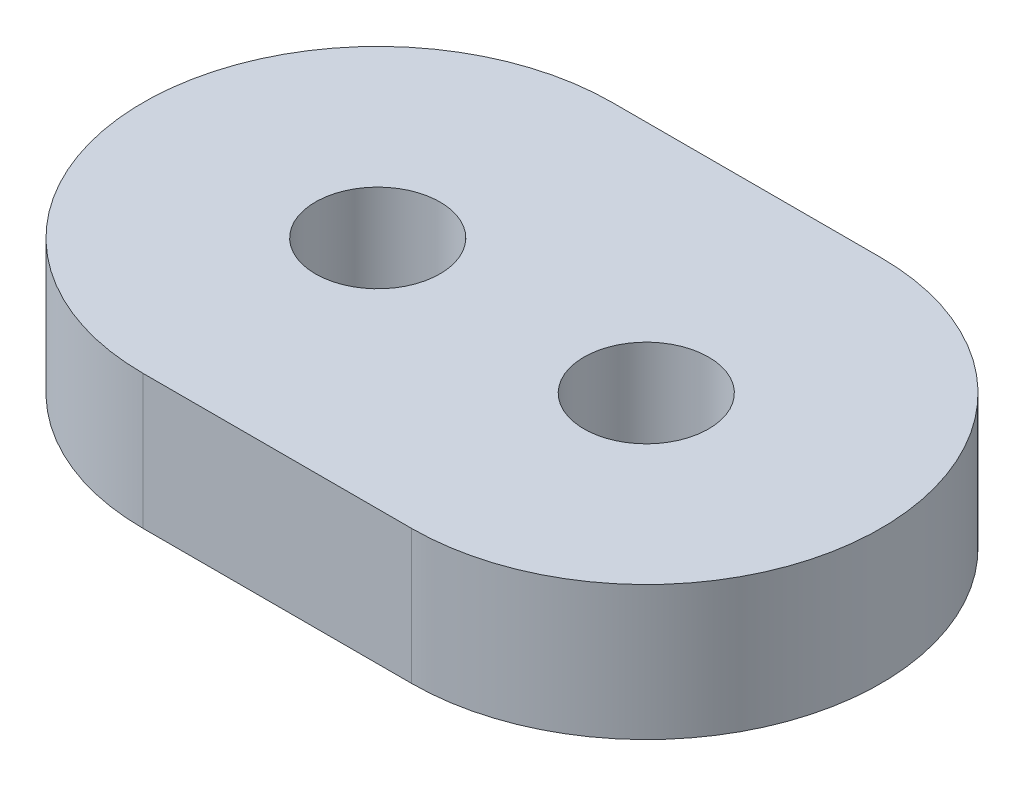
from build123d import *

# Parameters (mm, degrees)
SKETCH1_R      = 1.4732
EXTRUDE1_DEPTH = 3.175


with BuildPart() as part:
    # Sketch1 → Extrude1 (new body)
    with BuildSketch(Plane(origin=(0, 0, 0), x_dir=(1, 0, 0), z_dir=(0, 1, 0))):
        with BuildLine():
            Line((3.175, 18.973536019), (-3.175, 18.973536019))
            ThreePointArc((-3.175, 18.973536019), (-8.721874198, 24.520410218), (-3.175, 30.067284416))
            Line((-3.175, 30.067284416), (3.175, 30.067284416))
            ThreePointArc((3.175, 30.067284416), (8.721874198, 24.520410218), (3.175, 18.973536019))
        make_face()
        with Locations(Location((-3.175, 24.520410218, 0), (0, 0, 270))):
            Circle(SKETCH1_R, mode=Mode.SUBTRACT)
        with Locations(Location((3.175, 24.520410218, 0), (0, 0, 90))):
            Circle(SKETCH1_R, mode=Mode.SUBTRACT)
    extrude(amount=EXTRUDE1_DEPTH)


solid = part.part
